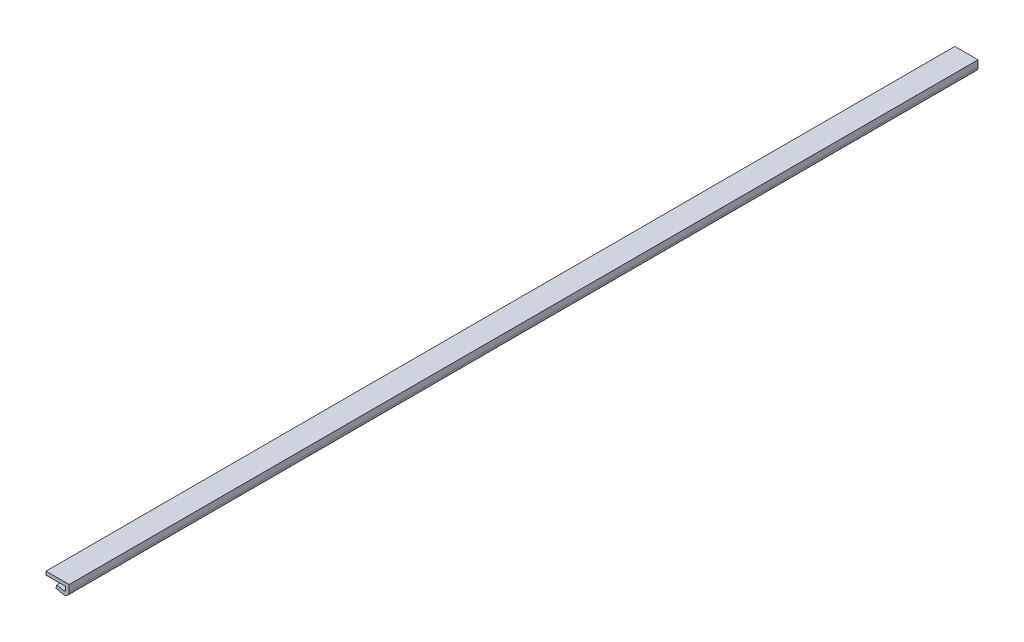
ISO-10303-21;
HEADER;
FILE_DESCRIPTION(('STEP AP214'),'2;1');
FILE_NAME('part.step','',(''),(''),'','','');
FILE_SCHEMA(('AUTOMOTIVE_DESIGN { 1 0 10303 214 1 1 1 1 }'));
ENDSEC;
DATA;
#1=APPLICATION_CONTEXT('core data for automotive mechanical design processes');
#2=APPLICATION_PROTOCOL_DEFINITION('international standard','automotive_design',2000,#1);
#3=PRODUCT_CONTEXT('',#1,'mechanical');
#4=PRODUCT('Part','Part','',(#3));
#5=PRODUCT_RELATED_PRODUCT_CATEGORY('part','',(#4));
#6=PRODUCT_DEFINITION_FORMATION('','',#4);
#7=PRODUCT_DEFINITION_CONTEXT('part definition',#1,'design');
#8=PRODUCT_DEFINITION('design','',#6,#7);
#9=PRODUCT_DEFINITION_SHAPE('','',#8);
#10=(LENGTH_UNIT() NAMED_UNIT(*) SI_UNIT(.MILLI.,.METRE.));
#11=(NAMED_UNIT(*) PLANE_ANGLE_UNIT() SI_UNIT($,.RADIAN.));
#12=(NAMED_UNIT(*) SI_UNIT($,.STERADIAN.) SOLID_ANGLE_UNIT());
#13=UNCERTAINTY_MEASURE_WITH_UNIT(LENGTH_MEASURE(1.E-05),#10,'distance_accuracy_value','');
#14=(GEOMETRIC_REPRESENTATION_CONTEXT(3) GLOBAL_UNCERTAINTY_ASSIGNED_CONTEXT((#13)) GLOBAL_UNIT_ASSIGNED_CONTEXT((#10,
#11,#12)) REPRESENTATION_CONTEXT('',''));
#15=CARTESIAN_POINT('',(0.,0.,0.));
#16=DIRECTION('',(0.,0.,1.));
#17=DIRECTION('',(1.,0.,0.));
#18=AXIS2_PLACEMENT_3D('',#15,#16,#17);
#19=CARTESIAN_POINT('',(0.,0.,785.));
#20=DIRECTION('',(1.,0.,0.));
#21=DIRECTION('',(0.,1.,0.));
#22=AXIS2_PLACEMENT_3D('',#19,#20,#21);
#23=PLANE('',#22);
#24=DIRECTION('',(0.,-1.,0.));
#25=VECTOR('',#24,1.);
#26=CARTESIAN_POINT('',(0.,0.,0.));
#27=LINE('',#26,#25);
#28=CARTESIAN_POINT('',(0.,0.,0.));
#29=VERTEX_POINT('',#28);
#30=CARTESIAN_POINT('',(0.,-3.,0.));
#31=VERTEX_POINT('',#30);
#32=EDGE_CURVE('E119',#29,#31,#27,.T.);
#33=ORIENTED_EDGE('',*,*,#32,.T.);
#34=DIRECTION('',(0.,0.,-1.));
#35=VECTOR('',#34,1.);
#36=CARTESIAN_POINT('',(0.,-3.,785.));
#37=LINE('',#36,#35);
#38=CARTESIAN_POINT('',(0.,-3.,785.));
#39=VERTEX_POINT('',#38);
#40=EDGE_CURVE('E11',#39,#31,#37,.T.);
#41=ORIENTED_EDGE('',*,*,#40,.F.);
#42=DIRECTION('',(0.,-1.,0.));
#43=VECTOR('',#42,1.);
#44=CARTESIAN_POINT('',(0.,0.,785.));
#45=LINE('',#44,#43);
#46=CARTESIAN_POINT('',(0.,0.,785.));
#47=VERTEX_POINT('',#46);
#48=EDGE_CURVE('E161',#47,#39,#45,.T.);
#49=ORIENTED_EDGE('',*,*,#48,.F.);
#50=DIRECTION('',(0.,0.,-1.));
#51=VECTOR('',#50,1.);
#52=CARTESIAN_POINT('',(0.,0.,785.));
#53=LINE('',#52,#51);
#54=EDGE_CURVE('E133',#47,#29,#53,.T.);
#55=ORIENTED_EDGE('',*,*,#54,.T.);
#56=EDGE_LOOP('',(#33,#41,#49,#55));
#57=FACE_BOUND('',#56,.T.);
#58=ADVANCED_FACE('F38',(#57),#23,.F.);
#59=CARTESIAN_POINT('',(0.,-3.,785.));
#60=DIRECTION('',(0.,1.,0.));
#61=DIRECTION('',(-1.,0.,0.));
#62=AXIS2_PLACEMENT_3D('',#59,#60,#61);
#63=PLANE('',#62);
#64=DIRECTION('',(1.,0.,0.));
#65=VECTOR('',#64,1.);
#66=CARTESIAN_POINT('',(0.,-3.,0.));
#67=LINE('',#66,#65);
#68=CARTESIAN_POINT('',(17.,-3.,0.));
#69=VERTEX_POINT('',#68);
#70=EDGE_CURVE('E115',#31,#69,#67,.T.);
#71=ORIENTED_EDGE('',*,*,#70,.T.);
#72=DIRECTION('',(0.,0.,-1.));
#73=VECTOR('',#72,1.);
#74=CARTESIAN_POINT('',(17.,-3.,785.));
#75=LINE('',#74,#73);
#76=CARTESIAN_POINT('',(17.,-3.,785.));
#77=VERTEX_POINT('',#76);
#78=EDGE_CURVE('E46',#77,#69,#75,.T.);
#79=ORIENTED_EDGE('',*,*,#78,.F.);
#80=DIRECTION('',(1.,0.,0.));
#81=VECTOR('',#80,1.);
#82=CARTESIAN_POINT('',(0.,-3.,785.));
#83=LINE('',#82,#81);
#84=EDGE_CURVE('E129',#39,#77,#83,.T.);
#85=ORIENTED_EDGE('',*,*,#84,.F.);
#86=ORIENTED_EDGE('',*,*,#40,.T.);
#87=EDGE_LOOP('',(#71,#79,#85,#86));
#88=FACE_BOUND('',#87,.T.);
#89=ADVANCED_FACE('F128',(#88),#63,.F.);
#90=CARTESIAN_POINT('',(17.,-3.,785.));
#91=DIRECTION('',(1.,0.,0.));
#92=DIRECTION('',(0.,0.,-1.));
#93=AXIS2_PLACEMENT_3D('',#90,#91,#92);
#94=PLANE('',#93);
#95=DIRECTION('',(0.,-1.,0.));
#96=VECTOR('',#95,1.);
#97=CARTESIAN_POINT('',(17.,-3.,0.));
#98=LINE('',#97,#96);
#99=CARTESIAN_POINT('',(17.,-5.49999999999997,0.));
#100=VERTEX_POINT('',#99);
#101=EDGE_CURVE('E121',#69,#100,#98,.T.);
#102=ORIENTED_EDGE('',*,*,#101,.T.);
#103=DIRECTION('',(0.,0.,-1.));
#104=VECTOR('',#103,1.);
#105=CARTESIAN_POINT('',(17.,-5.49999999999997,785.));
#106=LINE('',#105,#104);
#107=CARTESIAN_POINT('',(17.,-5.49999999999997,785.));
#108=VERTEX_POINT('',#107);
#109=EDGE_CURVE('E213',#108,#100,#106,.T.);
#110=ORIENTED_EDGE('',*,*,#109,.F.);
#111=DIRECTION('',(0.,-1.,0.));
#112=VECTOR('',#111,1.);
#113=CARTESIAN_POINT('',(17.,-3.,785.));
#114=LINE('',#113,#112);
#115=EDGE_CURVE('E166',#77,#108,#114,.T.);
#116=ORIENTED_EDGE('',*,*,#115,.F.);
#117=ORIENTED_EDGE('',*,*,#78,.T.);
#118=EDGE_LOOP('',(#102,#110,#116,#117));
#119=FACE_BOUND('',#118,.T.);
#120=ADVANCED_FACE('F219',(#119),#94,.F.);
#121=CARTESIAN_POINT('',(15.5,-5.5,785.));
#122=DIRECTION('',(0.,0.,-1.));
#123=DIRECTION('',(-1.,0.,0.));
#124=AXIS2_PLACEMENT_3D('',#121,#122,#123);
#125=CYLINDRICAL_SURFACE('',#124,1.5);
#126=CARTESIAN_POINT('',(15.5,-5.5,0.));
#127=DIRECTION('',(0.,0.,-1.));
#128=DIRECTION('',(1.,0.,0.));
#129=AXIS2_PLACEMENT_3D('',#126,#127,#128);
#130=CIRCLE('',#129,1.5);
#131=CARTESIAN_POINT('',(15.1371171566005,-6.955443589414,0.));
#132=VERTEX_POINT('',#131);
#133=EDGE_CURVE('E141',#100,#132,#130,.T.);
#134=ORIENTED_EDGE('',*,*,#133,.T.);
#135=DIRECTION('',(0.,0.,-1.));
#136=VECTOR('',#135,1.);
#137=CARTESIAN_POINT('',(15.1371171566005,-6.955443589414,785.));
#138=LINE('',#137,#136);
#139=CARTESIAN_POINT('',(15.1371171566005,-6.955443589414,785.));
#140=VERTEX_POINT('',#139);
#141=EDGE_CURVE('E209',#140,#132,#138,.T.);
#142=ORIENTED_EDGE('',*,*,#141,.F.);
#143=CARTESIAN_POINT('',(15.5,-5.5,785.));
#144=DIRECTION('',(0.,0.,-1.));
#145=DIRECTION('',(1.,0.,0.));
#146=AXIS2_PLACEMENT_3D('',#143,#144,#145);
#147=CIRCLE('',#146,1.5);
#148=EDGE_CURVE('E169',#108,#140,#147,.T.);
#149=ORIENTED_EDGE('',*,*,#148,.F.);
#150=ORIENTED_EDGE('',*,*,#109,.T.);
#151=EDGE_LOOP('',(#134,#142,#149,#150));
#152=FACE_BOUND('',#151,.T.);
#153=ADVANCED_FACE('F227',(#152),#125,.F.);
#154=CARTESIAN_POINT('',(9.2996517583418,-5.5,785.));
#155=DIRECTION('',(-0.241921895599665,-0.970295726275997,0.));
#156=DIRECTION('',(0.970295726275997,-0.241921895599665,0.));
#157=AXIS2_PLACEMENT_3D('',#154,#155,#156);
#158=PLANE('',#157);
#159=DIRECTION('',(-0.970295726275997,0.241921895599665,0.));
#160=VECTOR('',#159,1.);
#161=CARTESIAN_POINT('',(9.2996517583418,-5.5,0.));
#162=LINE('',#161,#160);
#163=CARTESIAN_POINT('',(9.2996517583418,-5.5,0.));
#164=VERTEX_POINT('',#163);
#165=EDGE_CURVE('E144',#132,#164,#162,.T.);
#166=ORIENTED_EDGE('',*,*,#165,.T.);
#167=DIRECTION('',(0.,0.,-1.));
#168=VECTOR('',#167,1.);
#169=CARTESIAN_POINT('',(9.2996517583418,-5.5,785.));
#170=LINE('',#169,#168);
#171=CARTESIAN_POINT('',(9.2996517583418,-5.5,785.));
#172=VERTEX_POINT('',#171);
#173=EDGE_CURVE('E205',#172,#164,#170,.T.);
#174=ORIENTED_EDGE('',*,*,#173,.F.);
#175=DIRECTION('',(-0.970295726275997,0.241921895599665,0.));
#176=VECTOR('',#175,1.);
#177=CARTESIAN_POINT('',(9.2996517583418,-5.5,785.));
#178=LINE('',#177,#176);
#179=EDGE_CURVE('E171',#140,#172,#178,.T.);
#180=ORIENTED_EDGE('',*,*,#179,.F.);
#181=ORIENTED_EDGE('',*,*,#141,.T.);
#182=EDGE_LOOP('',(#166,#174,#180,#181));
#183=FACE_BOUND('',#182,.T.);
#184=ADVANCED_FACE('F230',(#183),#158,.F.);
#185=CARTESIAN_POINT('',(8.57388607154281,-8.41088717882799,785.));
#186=DIRECTION('',(0.970295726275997,-0.241921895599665,0.));
#187=DIRECTION('',(0.241921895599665,0.970295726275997,0.));
#188=AXIS2_PLACEMENT_3D('',#185,#186,#187);
#189=PLANE('',#188);
#190=DIRECTION('',(-0.241921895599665,-0.970295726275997,0.));
#191=VECTOR('',#190,1.);
#192=CARTESIAN_POINT('',(8.57388607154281,-8.41088717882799,0.));
#193=LINE('',#192,#191);
#194=CARTESIAN_POINT('',(8.57388607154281,-8.41088717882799,0.));
#195=VERTEX_POINT('',#194);
#196=EDGE_CURVE('E147',#164,#195,#193,.T.);
#197=ORIENTED_EDGE('',*,*,#196,.T.);
#198=DIRECTION('',(0.,0.,-1.));
#199=VECTOR('',#198,1.);
#200=CARTESIAN_POINT('',(8.57388607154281,-8.41088717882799,785.));
#201=LINE('',#200,#199);
#202=CARTESIAN_POINT('',(8.57388607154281,-8.41088717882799,785.));
#203=VERTEX_POINT('',#202);
#204=EDGE_CURVE('E201',#203,#195,#201,.T.);
#205=ORIENTED_EDGE('',*,*,#204,.F.);
#206=DIRECTION('',(-0.241921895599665,-0.970295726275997,0.));
#207=VECTOR('',#206,1.);
#208=CARTESIAN_POINT('',(8.57388607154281,-8.41088717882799,785.));
#209=LINE('',#208,#207);
#210=EDGE_CURVE('E174',#172,#203,#209,.T.);
#211=ORIENTED_EDGE('',*,*,#210,.F.);
#212=ORIENTED_EDGE('',*,*,#173,.T.);
#213=EDGE_LOOP('',(#197,#205,#211,#212));
#214=FACE_BOUND('',#213,.T.);
#215=ADVANCED_FACE('F235',(#214),#189,.F.);
#216=CARTESIAN_POINT('',(14.4113514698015,-9.86633076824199,785.));
#217=DIRECTION('',(0.241921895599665,0.970295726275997,0.));
#218=DIRECTION('',(-0.970295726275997,0.241921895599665,0.));
#219=AXIS2_PLACEMENT_3D('',#216,#217,#218);
#220=PLANE('',#219);
#221=DIRECTION('',(0.970295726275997,-0.241921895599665,0.));
#222=VECTOR('',#221,1.);
#223=CARTESIAN_POINT('',(14.4113514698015,-9.86633076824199,0.));
#224=LINE('',#223,#222);
#225=CARTESIAN_POINT('',(14.4113514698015,-9.86633076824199,0.));
#226=VERTEX_POINT('',#225);
#227=EDGE_CURVE('E150',#195,#226,#224,.T.);
#228=ORIENTED_EDGE('',*,*,#227,.T.);
#229=DIRECTION('',(0.,0.,-1.));
#230=VECTOR('',#229,1.);
#231=CARTESIAN_POINT('',(14.4113514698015,-9.86633076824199,785.));
#232=LINE('',#231,#230);
#233=CARTESIAN_POINT('',(14.4113514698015,-9.86633076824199,785.));
#234=VERTEX_POINT('',#233);
#235=EDGE_CURVE('E197',#234,#226,#232,.T.);
#236=ORIENTED_EDGE('',*,*,#235,.F.);
#237=DIRECTION('',(0.970295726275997,-0.241921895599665,0.));
#238=VECTOR('',#237,1.);
#239=CARTESIAN_POINT('',(14.4113514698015,-9.86633076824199,785.));
#240=LINE('',#239,#238);
#241=EDGE_CURVE('E177',#203,#234,#240,.T.);
#242=ORIENTED_EDGE('',*,*,#241,.F.);
#243=ORIENTED_EDGE('',*,*,#204,.T.);
#244=EDGE_LOOP('',(#228,#236,#242,#243));
#245=FACE_BOUND('',#244,.T.);
#246=ADVANCED_FACE('F241',(#245),#220,.F.);
#247=CARTESIAN_POINT('',(15.5,-5.5,785.));
#248=DIRECTION('',(0.,0.,-1.));
#249=DIRECTION('',(-1.,0.,0.));
#250=AXIS2_PLACEMENT_3D('',#247,#248,#249);
#251=CYLINDRICAL_SURFACE('',#250,4.5);
#252=CARTESIAN_POINT('',(15.5,-5.5,0.));
#253=DIRECTION('',(0.,0.,1.));
#254=DIRECTION('',(-1.,0.,0.));
#255=AXIS2_PLACEMENT_3D('',#252,#253,#254);
#256=CIRCLE('',#255,4.5);
#257=CARTESIAN_POINT('',(20.,-5.5,0.));
#258=VERTEX_POINT('',#257);
#259=EDGE_CURVE('E153',#226,#258,#256,.T.);
#260=ORIENTED_EDGE('',*,*,#259,.T.);
#261=DIRECTION('',(0.,0.,-1.));
#262=VECTOR('',#261,1.);
#263=CARTESIAN_POINT('',(20.,-5.5,785.));
#264=LINE('',#263,#262);
#265=CARTESIAN_POINT('',(20.,-5.5,785.));
#266=VERTEX_POINT('',#265);
#267=EDGE_CURVE('E193',#266,#258,#264,.T.);
#268=ORIENTED_EDGE('',*,*,#267,.F.);
#269=CARTESIAN_POINT('',(15.5,-5.5,785.));
#270=DIRECTION('',(0.,0.,1.));
#271=DIRECTION('',(-1.,0.,0.));
#272=AXIS2_PLACEMENT_3D('',#269,#270,#271);
#273=CIRCLE('',#272,4.5);
#274=EDGE_CURVE('E180',#234,#266,#273,.T.);
#275=ORIENTED_EDGE('',*,*,#274,.F.);
#276=ORIENTED_EDGE('',*,*,#235,.T.);
#277=EDGE_LOOP('',(#260,#268,#275,#276));
#278=FACE_BOUND('',#277,.T.);
#279=ADVANCED_FACE('F245',(#278),#251,.T.);
#280=CARTESIAN_POINT('',(20.,0.,785.));
#281=DIRECTION('',(-1.,0.,0.));
#282=DIRECTION('',(0.,0.,1.));
#283=AXIS2_PLACEMENT_3D('',#280,#281,#282);
#284=PLANE('',#283);
#285=DIRECTION('',(0.,1.,0.));
#286=VECTOR('',#285,1.);
#287=CARTESIAN_POINT('',(20.,0.,0.));
#288=LINE('',#287,#286);
#289=CARTESIAN_POINT('',(20.,0.,0.));
#290=VERTEX_POINT('',#289);
#291=EDGE_CURVE('E155',#258,#290,#288,.T.);
#292=ORIENTED_EDGE('',*,*,#291,.T.);
#293=DIRECTION('',(0.,0.,-1.));
#294=VECTOR('',#293,1.);
#295=CARTESIAN_POINT('',(20.,0.,785.));
#296=LINE('',#295,#294);
#297=CARTESIAN_POINT('',(20.,0.,785.));
#298=VERTEX_POINT('',#297);
#299=EDGE_CURVE('E189',#298,#290,#296,.T.);
#300=ORIENTED_EDGE('',*,*,#299,.F.);
#301=DIRECTION('',(0.,1.,0.));
#302=VECTOR('',#301,1.);
#303=CARTESIAN_POINT('',(20.,0.,785.));
#304=LINE('',#303,#302);
#305=EDGE_CURVE('E58',#266,#298,#304,.T.);
#306=ORIENTED_EDGE('',*,*,#305,.F.);
#307=ORIENTED_EDGE('',*,*,#267,.T.);
#308=EDGE_LOOP('',(#292,#300,#306,#307));
#309=FACE_BOUND('',#308,.T.);
#310=ADVANCED_FACE('F248',(#309),#284,.F.);
#311=CARTESIAN_POINT('',(0.,0.,785.));
#312=DIRECTION('',(0.,-1.,0.));
#313=DIRECTION('',(0.,0.,-1.));
#314=AXIS2_PLACEMENT_3D('',#311,#312,#313);
#315=PLANE('',#314);
#316=DIRECTION('',(-1.,0.,0.));
#317=VECTOR('',#316,1.);
#318=CARTESIAN_POINT('',(0.,0.,0.));
#319=LINE('',#318,#317);
#320=EDGE_CURVE('E158',#290,#29,#319,.T.);
#321=ORIENTED_EDGE('',*,*,#320,.T.);
#322=ORIENTED_EDGE('',*,*,#54,.F.);
#323=DIRECTION('',(-1.,0.,0.));
#324=VECTOR('',#323,1.);
#325=CARTESIAN_POINT('',(0.,0.,785.));
#326=LINE('',#325,#324);
#327=EDGE_CURVE('E53',#298,#47,#326,.T.);
#328=ORIENTED_EDGE('',*,*,#327,.F.);
#329=ORIENTED_EDGE('',*,*,#299,.T.);
#330=EDGE_LOOP('',(#321,#322,#328,#329));
#331=FACE_BOUND('',#330,.T.);
#332=ADVANCED_FACE('F250',(#331),#315,.F.);
#333=CARTESIAN_POINT('',(15.5,-5.5,785.));
#334=DIRECTION('',(0.,0.,1.));
#335=DIRECTION('',(1.,0.,0.));
#336=AXIS2_PLACEMENT_3D('',#333,#334,#335);
#337=PLANE('',#336);
#338=ORIENTED_EDGE('',*,*,#48,.T.);
#339=ORIENTED_EDGE('',*,*,#84,.T.);
#340=ORIENTED_EDGE('',*,*,#115,.T.);
#341=ORIENTED_EDGE('',*,*,#148,.T.);
#342=ORIENTED_EDGE('',*,*,#179,.T.);
#343=ORIENTED_EDGE('',*,*,#210,.T.);
#344=ORIENTED_EDGE('',*,*,#241,.T.);
#345=ORIENTED_EDGE('',*,*,#274,.T.);
#346=ORIENTED_EDGE('',*,*,#305,.T.);
#347=ORIENTED_EDGE('',*,*,#327,.T.);
#348=EDGE_LOOP('',(#338,#339,#340,#341,#342,#343,#344,#345,#346,#347));
#349=FACE_BOUND('',#348,.T.);
#350=ADVANCED_FACE('F222',(#349),#337,.T.);
#351=CARTESIAN_POINT('',(15.5,-5.5,0.));
#352=DIRECTION('',(0.,0.,1.));
#353=DIRECTION('',(1.,0.,0.));
#354=AXIS2_PLACEMENT_3D('',#351,#352,#353);
#355=PLANE('',#354);
#356=ORIENTED_EDGE('',*,*,#32,.F.);
#357=ORIENTED_EDGE('',*,*,#320,.F.);
#358=ORIENTED_EDGE('',*,*,#291,.F.);
#359=ORIENTED_EDGE('',*,*,#259,.F.);
#360=ORIENTED_EDGE('',*,*,#227,.F.);
#361=ORIENTED_EDGE('',*,*,#196,.F.);
#362=ORIENTED_EDGE('',*,*,#165,.F.);
#363=ORIENTED_EDGE('',*,*,#133,.F.);
#364=ORIENTED_EDGE('',*,*,#101,.F.);
#365=ORIENTED_EDGE('',*,*,#70,.F.);
#366=EDGE_LOOP('',(#356,#357,#358,#359,#360,#361,#362,#363,#364,#365));
#367=FACE_BOUND('',#366,.T.);
#368=ADVANCED_FACE('F116',(#367),#355,.F.);
#369=CLOSED_SHELL('',(#58,#89,#120,#153,#184,#215,#246,#279,#310,#332,#350,#368));
#370=MANIFOLD_SOLID_BREP('B2',#369);
#371=ADVANCED_BREP_SHAPE_REPRESENTATION('',(#18,#370),#14);
#372=SHAPE_DEFINITION_REPRESENTATION(#9,#371);
ENDSEC;
END-ISO-10303-21;
